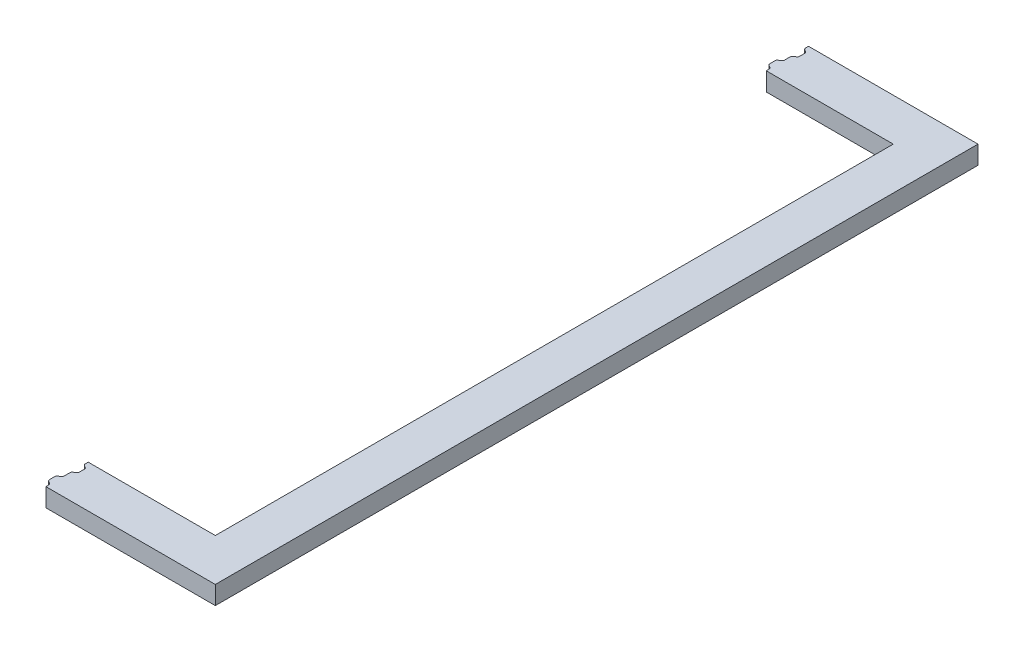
from build123d import *

# Parameters (mm, degrees)
EXTRUSION1_DEPTH = 13


with BuildPart() as part:
    # Esquisse1 → Extrusion1 (new body)
    with BuildSketch(Plane(origin=(0, 0, 0), x_dir=(1, 0, 0), z_dir=(0, 1, 0))):
        with BuildLine():
            Line((0, -480.2), (0, -482.076239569))
            ThreePointArc((0, -482.076239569), (0.214359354, -482.876239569), (0.8, -483.461880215))
            Line((0.8, -483.461880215), (2.2, -484.270170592))
            ThreePointArc((2.2, -484.270170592), (2.785640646, -484.855811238), (3, -485.655811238))
            Line((3, -485.655811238), (3, -489.339621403))
            ThreePointArc((3, -489.339621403), (2.786262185, -490.1385439), (2.202153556, -490.72401646))
            Line((2.202153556, -490.72401646), (0.797846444, -491.537707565))
            ThreePointArc((0.797846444, -491.537707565), (0.213737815, -492.123180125), (0, -492.922102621))
            Line((0, -492.922102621), (0, -497.077897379))
            ThreePointArc((0, -497.077897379), (-0.213737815, -497.876819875), (-0.797846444, -498.462292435))
            Line((-0.797846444, -498.462292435), (-2.202153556, -499.27598354))
            ThreePointArc((-2.202153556, -499.27598354), (-2.786262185, -499.8614561), (-3, -500.660378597))
            Line((-3, -500.660378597), (-3, -504.344188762))
            ThreePointArc((-3, -504.344188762), (-2.785640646, -505.144188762), (-2.2, -505.729829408))
            Line((-2.2, -505.729829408), (-0.8, -506.538119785))
            ThreePointArc((-0.8, -506.538119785), (-0.214359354, -507.123760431), (0, -507.923760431))
            Line((0, -507.923760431), (0, -509.8))
            ThreePointArc((0, -509.8), (0.058578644, -509.941421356), (0.2, -510))
            Line((0.2, -510), (120, -510))
            Line((120, -510), (120, 30))
            Line((120, 30), (0.2, 30))
            ThreePointArc((0.2, 30), (0.058578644, 29.941421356), (0, 29.8))
            Line((0, 29.8), (0, 27.923760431))
            ThreePointArc((0, 27.923760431), (0.214359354, 27.123760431), (0.8, 26.538119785))
            Line((0.8, 26.538119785), (2.2, 25.729829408))
            ThreePointArc((2.2, 25.729829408), (2.785640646, 25.144188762), (3, 24.344188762))
            Line((3, 24.344188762), (3, 20.660378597))
            ThreePointArc((3, 20.660378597), (2.786262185, 19.8614561), (2.202153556, 19.27598354))
            Line((2.202153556, 19.27598354), (0.797846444, 18.462292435))
            ThreePointArc((0.797846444, 18.462292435), (0.213737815, 17.876819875), (0, 17.077897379))
            Line((0, 17.077897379), (0, 12.922102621))
            ThreePointArc((0, 12.922102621), (-0.213737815, 12.123180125), (-0.797846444, 11.537707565))
            Line((-0.797846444, 11.537707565), (-2.202153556, 10.72401646))
            ThreePointArc((-2.202153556, 10.72401646), (-2.786262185, 10.1385439), (-3, 9.339621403))
            Line((-3, 9.339621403), (-3, 5.655811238))
            ThreePointArc((-3, 5.655811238), (-2.785640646, 4.855811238), (-2.2, 4.270170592))
            Line((-2.2, 4.270170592), (-0.8, 3.461880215))
            ThreePointArc((-0.8, 3.461880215), (-0.214359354, 2.876239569), (0, 2.076239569))
            Line((0, 2.076239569), (0, 0.2))
            ThreePointArc((0, 0.2), (0.058578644, 0.058578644), (0.2, 0))
            Line((0.2, 0), (90, 0))
            Line((90, 0), (90, -480))
            Line((90, -480), (0.2, -480))
            ThreePointArc((0.2, -480), (0.058578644, -480.058578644), (0, -480.2))
        make_face()
    extrude(amount=EXTRUSION1_DEPTH)


solid = part.part
